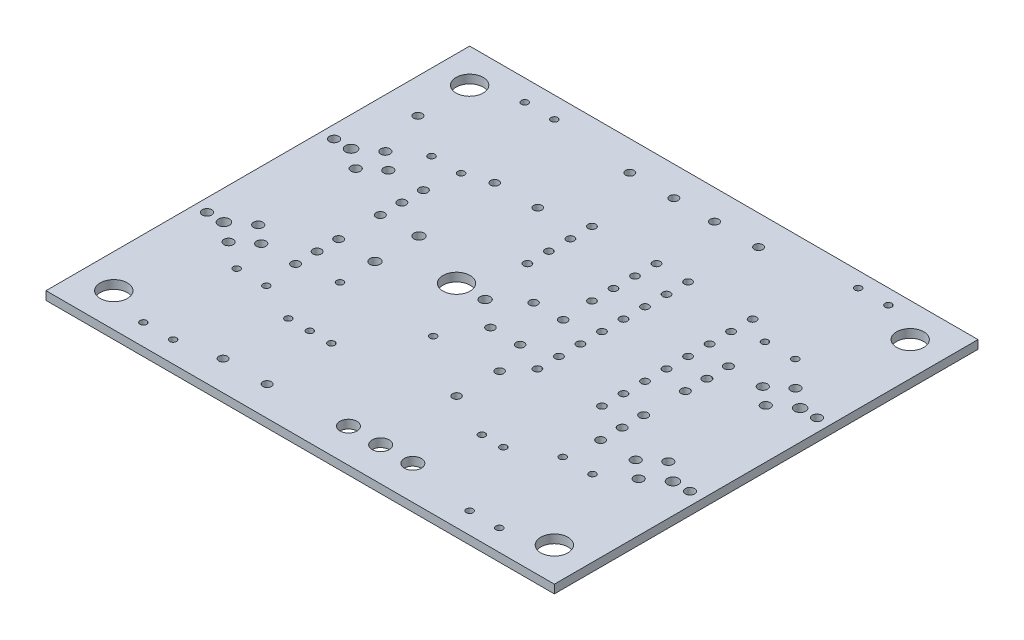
from build123d import *

# Parameters (mm, degrees)
ESQUISSE2_W      = 60
ESQUISSE2_H      = 50
ESQUISSE2_R      = 0.59944
ESQUISSE2_R_2    = 1.6002
ESQUISSE2_R_3    = 0.50038
ESQUISSE2_R_4    = 0.4826
ESQUISSE2_R_5    = 0.39878
ESQUISSE2_R_6    = 0.55118
ESQUISSE2_R_7    = 0.65024
ESQUISSE2_R_8    = 0.44958
ESQUISSE2_R_9    = 1.00076
EXTRUSION1_DEPTH = 1


with BuildPart() as part:
    # Esquisse2 → Extrusion1 (new body)
    with BuildSketch(Plane(origin=(0, 0, 0), x_dir=(1, 0, 0), z_dir=(0, 1, 0))):
        with Locations((30, 25)):
            Rectangle(ESQUISSE2_W, ESQUISSE2_H)
        with Locations(Location((16.42618, 27.59964, 0), (0, 0, 270))):
            Circle(ESQUISSE2_R, mode=Mode.SUBTRACT)
        with Locations(Location((16.42618, 22.40026, 0), (0, 0, 270))):
            Circle(ESQUISSE2_R, mode=Mode.SUBTRACT)
        with Locations(Location((26.82494, 25.00122, 0), (0, 0, 270))):
            Circle(ESQUISSE2_R, mode=Mode.SUBTRACT)
        with Locations(Location((23.4696, 24.9809, 0), (0, 0, 270))):
            Circle(ESQUISSE2_R_2, mode=Mode.SUBTRACT)
        with Locations(Location((22.60092, 3.50012, 0), (0, 0, 270))):
            Circle(ESQUISSE2_R_3, mode=Mode.SUBTRACT)
        with Locations(Location((17.399, 3.50012, 0), (0, 0, 270))):
            Circle(ESQUISSE2_R_3, mode=Mode.SUBTRACT)
        with Locations(Location((29.99994, 27.54122, 0), (0, 0, 270))):
            Circle(ESQUISSE2_R_4, mode=Mode.SUBTRACT)
        with Locations(Location((29.99994, 22.46122, 0), (0, 0, 270))):
            Circle(ESQUISSE2_R_4, mode=Mode.SUBTRACT)
        with Locations(Location((33.50006, 27.54122, 0), (0, 0, 270))):
            Circle(ESQUISSE2_R_4, mode=Mode.SUBTRACT)
        with Locations(Location((33.50006, 22.46122, 0), (0, 0, 270))):
            Circle(ESQUISSE2_R_4, mode=Mode.SUBTRACT)
        with Locations(Location((15.46098, 37.50056, 0), (0, 0, 270))):
            Circle(ESQUISSE2_R_4, mode=Mode.SUBTRACT)
        with Locations(Location((20.54098, 37.50056, 0), (0, 0, 270))):
            Circle(ESQUISSE2_R_4, mode=Mode.SUBTRACT)
        with Locations(Location((35.0012, 13.45946, 0), (0, 0, 270))):
            Circle(ESQUISSE2_R_4, mode=Mode.SUBTRACT)
        with Locations(Location((35.0012, 18.53946, 0), (0, 0, 270))):
            Circle(ESQUISSE2_R_4, mode=Mode.SUBTRACT)
        with Locations(Location((42.99458, 10.99058, 0), (0, 0, 270))):
            Circle(ESQUISSE2_R_5, mode=Mode.SUBTRACT)
        with Locations(Location((40.45458, 10.99058, 0), (0, 0, 270))):
            Circle(ESQUISSE2_R_5, mode=Mode.SUBTRACT)
        with Locations(Location((1.4986, 32.50184, 0), (0, 0, 270))):
            Circle(ESQUISSE2_R_6, mode=Mode.SUBTRACT)
        with Locations(Location((7.8994, 32.50184, 0), (0, 0, 270))):
            Circle(ESQUISSE2_R_6, mode=Mode.SUBTRACT)
        with Locations(Location((5.79882, 30.75178, 0), (0, 0, 270))):
            Circle(ESQUISSE2_R_6, mode=Mode.SUBTRACT)
        with Locations(Location((5.79882, 34.2519, 0), (0, 0, 270))):
            Circle(ESQUISSE2_R_6, mode=Mode.SUBTRACT)
        with Locations(Location((3.50012, 32.50184, 0), (0, 0, 270))):
            Circle(ESQUISSE2_R_7, mode=Mode.SUBTRACT)
        with Locations(Location((1.4986, 17.5006, 0), (0, 0, 270))):
            Circle(ESQUISSE2_R_6, mode=Mode.SUBTRACT)
        with Locations(Location((7.8994, 17.5006, 0), (0, 0, 270))):
            Circle(ESQUISSE2_R_6, mode=Mode.SUBTRACT)
        with Locations(Location((5.79882, 15.75054, 0), (0, 0, 270))):
            Circle(ESQUISSE2_R_6, mode=Mode.SUBTRACT)
        with Locations(Location((5.79882, 19.25066, 0), (0, 0, 270))):
            Circle(ESQUISSE2_R_6, mode=Mode.SUBTRACT)
        with Locations(Location((3.50012, 17.5006, 0), (0, 0, 270))):
            Circle(ESQUISSE2_R_7, mode=Mode.SUBTRACT)
        with Locations(Location((58.50128, 32.4993, 0), (0, 0, 270))):
            Circle(ESQUISSE2_R_6, mode=Mode.SUBTRACT)
        with Locations(Location((52.10048, 32.4993, 0), (0, 0, 270))):
            Circle(ESQUISSE2_R_6, mode=Mode.SUBTRACT)
        with Locations(Location((54.20106, 34.24936, 0), (0, 0, 270))):
            Circle(ESQUISSE2_R_6, mode=Mode.SUBTRACT)
        with Locations(Location((54.20106, 30.74924, 0), (0, 0, 270))):
            Circle(ESQUISSE2_R_6, mode=Mode.SUBTRACT)
        with Locations(Location((56.49976, 32.4993, 0), (0, 0, 270))):
            Circle(ESQUISSE2_R_7, mode=Mode.SUBTRACT)
        with Locations(Location((58.50128, 17.49806, 0), (0, 0, 270))):
            Circle(ESQUISSE2_R_6, mode=Mode.SUBTRACT)
        with Locations(Location((52.10048, 17.49806, 0), (0, 0, 270))):
            Circle(ESQUISSE2_R_6, mode=Mode.SUBTRACT)
        with Locations(Location((54.20106, 19.24812, 0), (0, 0, 270))):
            Circle(ESQUISSE2_R_6, mode=Mode.SUBTRACT)
        with Locations(Location((54.20106, 15.748, 0), (0, 0, 270))):
            Circle(ESQUISSE2_R_6, mode=Mode.SUBTRACT)
        with Locations(Location((56.49976, 17.49806, 0), (0, 0, 270))):
            Circle(ESQUISSE2_R_7, mode=Mode.SUBTRACT)
        with Locations(Location((4.0005, 45.9994, 0), (0, 0, 270))):
            Circle(ESQUISSE2_R_2, mode=Mode.SUBTRACT)
        with Locations(Location((55.99938, 45.9994, 0), (0, 0, 270))):
            Circle(ESQUISSE2_R_2, mode=Mode.SUBTRACT)
        with Locations(Location((55.99938, 4.0005, 0), (0, 0, 270))):
            Circle(ESQUISSE2_R_2, mode=Mode.SUBTRACT)
        with Locations(Location((4.0005, 4.0005, 0), (0, 0, 270))):
            Circle(ESQUISSE2_R_2, mode=Mode.SUBTRACT)
        with Locations(Location((25.64892, 38.78834, 0), (0, 0, 270))):
            Circle(ESQUISSE2_R_8, mode=Mode.SUBTRACT)
        with Locations(Location((25.64892, 36.24834, 0), (0, 0, 270))):
            Circle(ESQUISSE2_R_8, mode=Mode.SUBTRACT)
        with Locations(Location((25.64892, 33.70834, 0), (0, 0, 270))):
            Circle(ESQUISSE2_R_8, mode=Mode.SUBTRACT)
        with Locations(Location((25.64892, 31.16834, 0), (0, 0, 270))):
            Circle(ESQUISSE2_R_8, mode=Mode.SUBTRACT)
        with Locations(Location((33.26892, 31.16834, 0), (0, 0, 270))):
            Circle(ESQUISSE2_R_8, mode=Mode.SUBTRACT)
        with Locations(Location((33.26892, 33.70834, 0), (0, 0, 270))):
            Circle(ESQUISSE2_R_8, mode=Mode.SUBTRACT)
        with Locations(Location((33.26892, 36.24834, 0), (0, 0, 270))):
            Circle(ESQUISSE2_R_8, mode=Mode.SUBTRACT)
        with Locations(Location((33.26892, 38.78834, 0), (0, 0, 270))):
            Circle(ESQUISSE2_R_8, mode=Mode.SUBTRACT)
        with Locations(Location((36.99256, 38.7858, 0), (0, 0, 270))):
            Circle(ESQUISSE2_R_8, mode=Mode.SUBTRACT)
        with Locations(Location((36.99256, 36.2458, 0), (0, 0, 270))):
            Circle(ESQUISSE2_R_8, mode=Mode.SUBTRACT)
        with Locations(Location((36.99256, 33.7058, 0), (0, 0, 270))):
            Circle(ESQUISSE2_R_8, mode=Mode.SUBTRACT)
        with Locations(Location((36.99256, 31.1658, 0), (0, 0, 270))):
            Circle(ESQUISSE2_R_8, mode=Mode.SUBTRACT)
        with Locations(Location((36.99256, 28.6258, 0), (0, 0, 270))):
            Circle(ESQUISSE2_R_8, mode=Mode.SUBTRACT)
        with Locations(Location((36.99256, 26.0858, 0), (0, 0, 270))):
            Circle(ESQUISSE2_R_8, mode=Mode.SUBTRACT)
        with Locations(Location((36.99256, 23.5458, 0), (0, 0, 270))):
            Circle(ESQUISSE2_R_8, mode=Mode.SUBTRACT)
        with Locations(Location((36.99256, 21.0058, 0), (0, 0, 270))):
            Circle(ESQUISSE2_R_8, mode=Mode.SUBTRACT)
        with Locations(Location((44.61256, 21.0058, 0), (0, 0, 270))):
            Circle(ESQUISSE2_R_8, mode=Mode.SUBTRACT)
        with Locations(Location((44.61256, 23.5458, 0), (0, 0, 270))):
            Circle(ESQUISSE2_R_8, mode=Mode.SUBTRACT)
        with Locations(Location((44.61256, 26.0858, 0), (0, 0, 270))):
            Circle(ESQUISSE2_R_8, mode=Mode.SUBTRACT)
        with Locations(Location((44.61256, 28.6258, 0), (0, 0, 270))):
            Circle(ESQUISSE2_R_8, mode=Mode.SUBTRACT)
        with Locations(Location((44.61256, 31.1658, 0), (0, 0, 270))):
            Circle(ESQUISSE2_R_8, mode=Mode.SUBTRACT)
        with Locations(Location((44.61256, 33.7058, 0), (0, 0, 270))):
            Circle(ESQUISSE2_R_8, mode=Mode.SUBTRACT)
        with Locations(Location((44.61256, 36.2458, 0), (0, 0, 270))):
            Circle(ESQUISSE2_R_8, mode=Mode.SUBTRACT)
        with Locations(Location((44.61256, 38.7858, 0), (0, 0, 270))):
            Circle(ESQUISSE2_R_8, mode=Mode.SUBTRACT)
        with Locations(Location((17.145, 11.46048, 0), (0, 0, 270))):
            Circle(ESQUISSE2_R_5, mode=Mode.SUBTRACT)
        with Locations(Location((19.685, 11.46048, 0), (0, 0, 270))):
            Circle(ESQUISSE2_R_5, mode=Mode.SUBTRACT)
        with Locations(Location((22.225, 11.46048, 0), (0, 0, 270))):
            Circle(ESQUISSE2_R_5, mode=Mode.SUBTRACT)
        with Locations(Location((22.40026, 46.49978, 0), (0, 0, 270))):
            Circle(ESQUISSE2_R_3, mode=Mode.SUBTRACT)
        with Locations(Location((27.59964, 46.49978, 0), (0, 0, 270))):
            Circle(ESQUISSE2_R_3, mode=Mode.SUBTRACT)
        with Locations(Location((32.40024, 46.49978, 0), (0, 0, 270))):
            Circle(ESQUISSE2_R_3, mode=Mode.SUBTRACT)
        with Locations(Location((37.59962, 46.49978, 0), (0, 0, 270))):
            Circle(ESQUISSE2_R_3, mode=Mode.SUBTRACT)
        with Locations(Location((8.99922, 36.4998, 0), (0, 0, 270))):
            Circle(ESQUISSE2_R_5, mode=Mode.SUBTRACT)
        with Locations(Location((8.99922, 47.50054, 0), (0, 0, 270))):
            Circle(ESQUISSE2_R_5, mode=Mode.SUBTRACT)
        with Locations(Location((12.49934, 13.5001, 0), (0, 0, 270))):
            Circle(ESQUISSE2_R_5, mode=Mode.SUBTRACT)
        with Locations(Location((12.49934, 2.49936, 0), (0, 0, 270))):
            Circle(ESQUISSE2_R_5, mode=Mode.SUBTRACT)
        with Locations(Location((8.99922, 13.5001, 0), (0, 0, 270))):
            Circle(ESQUISSE2_R_5, mode=Mode.SUBTRACT)
        with Locations(Location((8.99922, 2.49936, 0), (0, 0, 270))):
            Circle(ESQUISSE2_R_5, mode=Mode.SUBTRACT)
        with Locations(Location((47.50054, 2.49936, 0), (0, 0, 270))):
            Circle(ESQUISSE2_R_5, mode=Mode.SUBTRACT)
        with Locations(Location((47.50054, 13.5001, 0), (0, 0, 270))):
            Circle(ESQUISSE2_R_5, mode=Mode.SUBTRACT)
        with Locations(Location((51.00066, 13.5001, 0), (0, 0, 270))):
            Circle(ESQUISSE2_R_5, mode=Mode.SUBTRACT)
        with Locations(Location((51.00066, 2.49936, 0), (0, 0, 270))):
            Circle(ESQUISSE2_R_5, mode=Mode.SUBTRACT)
        with Locations(Location((12.49934, 36.4998, 0), (0, 0, 270))):
            Circle(ESQUISSE2_R_5, mode=Mode.SUBTRACT)
        with Locations(Location((12.49934, 47.50054, 0), (0, 0, 270))):
            Circle(ESQUISSE2_R_5, mode=Mode.SUBTRACT)
        with Locations(Location((47.6631, 37.19068, 0), (0, 0, 270))):
            Circle(ESQUISSE2_R_5, mode=Mode.SUBTRACT)
        with Locations(Location((47.6631, 48.19142, 0), (0, 0, 270))):
            Circle(ESQUISSE2_R_5, mode=Mode.SUBTRACT)
        with Locations(Location((51.20132, 37.22624, 0), (0, 0, 270))):
            Circle(ESQUISSE2_R_5, mode=Mode.SUBTRACT)
        with Locations(Location((51.20132, 48.22698, 0), (0, 0, 270))):
            Circle(ESQUISSE2_R_5, mode=Mode.SUBTRACT)
        with Locations(Location((16.49984, 18.1991, 0), (0, 0, 270))):
            Circle(ESQUISSE2_R_5, mode=Mode.SUBTRACT)
        with Locations(Location((27.50058, 18.1991, 0), (0, 0, 270))):
            Circle(ESQUISSE2_R_5, mode=Mode.SUBTRACT)
        with Locations(Location((35.49904, 4.0005, 0), (0, 0, 270))):
            Circle(ESQUISSE2_R_9, mode=Mode.SUBTRACT)
        with Locations(Location((39.29888, 4.0005, 0), (0, 0, 270))):
            Circle(ESQUISSE2_R_9, mode=Mode.SUBTRACT)
        with Locations(Location((31.6992, 4.0005, 0), (0, 0, 270))):
            Circle(ESQUISSE2_R_9, mode=Mode.SUBTRACT)
        with Locations(Location((11.99896, 27.45994, 0), (0, 0, 270))):
            Circle(ESQUISSE2_R_3, mode=Mode.SUBTRACT)
        with Locations(Location((11.99896, 29.99994, 0), (0, 0, 270))):
            Circle(ESQUISSE2_R_3, mode=Mode.SUBTRACT)
        with Locations(Location((11.99896, 32.53994, 0), (0, 0, 270))):
            Circle(ESQUISSE2_R_3, mode=Mode.SUBTRACT)
        with Locations(Location((11.99896, 17.45996, 0), (0, 0, 270))):
            Circle(ESQUISSE2_R_3, mode=Mode.SUBTRACT)
        with Locations(Location((11.99896, 19.99996, 0), (0, 0, 270))):
            Circle(ESQUISSE2_R_3, mode=Mode.SUBTRACT)
        with Locations(Location((11.99896, 22.53996, 0), (0, 0, 270))):
            Circle(ESQUISSE2_R_3, mode=Mode.SUBTRACT)
        with Locations(Location((48.00092, 27.45994, 0), (0, 0, 270))):
            Circle(ESQUISSE2_R_3, mode=Mode.SUBTRACT)
        with Locations(Location((48.00092, 29.99994, 0), (0, 0, 270))):
            Circle(ESQUISSE2_R_3, mode=Mode.SUBTRACT)
        with Locations(Location((48.00092, 32.53994, 0), (0, 0, 270))):
            Circle(ESQUISSE2_R_3, mode=Mode.SUBTRACT)
        with Locations(Location((48.00092, 17.45996, 0), (0, 0, 270))):
            Circle(ESQUISSE2_R_3, mode=Mode.SUBTRACT)
        with Locations(Location((48.00092, 19.99996, 0), (0, 0, 270))):
            Circle(ESQUISSE2_R_3, mode=Mode.SUBTRACT)
        with Locations(Location((48.00092, 22.53996, 0), (0, 0, 270))):
            Circle(ESQUISSE2_R_3, mode=Mode.SUBTRACT)
        with Locations(Location((4.0767, 39.81958, 0), (0, 0, 270))):
            Circle(ESQUISSE2_R_3, mode=Mode.SUBTRACT)
    extrude(amount=EXTRUSION1_DEPTH)


solid = part.part
